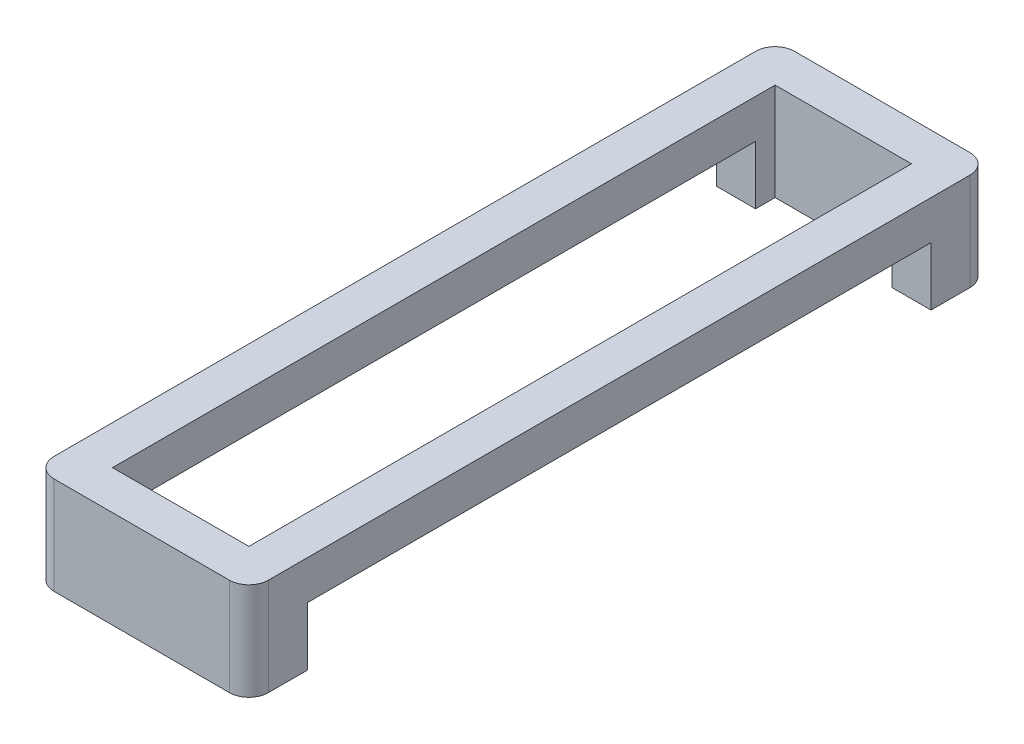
from build123d import *

# Parameters (mm, degrees)
ESQUISSE1_W             = 3.5
ESQUISSE1_H             = 17
EXTRUSION1_DEPTH        = 2.5
ESQUISSE2_W             = 16
ESQUISSE2_H             = 3.978348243
ENL_V_MAT_EXTRU_1_DEPTH = 6.25


with BuildPart() as part:
    # Esquisse1 → Extrusion1 (new body)
    with BuildSketch(Plane(origin=(0, 0, 0), x_dir=(1, 0, 0), z_dir=(0, 1, 0))):
        with BuildLine():
            Line((-2.25, -9.5), (2.25, -9.5))
            ThreePointArc((2.25, -9.5), (2.603553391, -9.353553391), (2.75, -9))
            Line((2.75, -9), (2.75, 9))
            ThreePointArc((2.75, 9), (2.603553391, 9.353553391), (2.25, 9.5))
            Line((2.25, 9.5), (-2.25, 9.5))
            ThreePointArc((-2.25, 9.5), (-2.603553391, 9.353553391), (-2.75, 9))
            Line((-2.75, 9), (-2.75, -9))
            ThreePointArc((-2.75, -9), (-2.603553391, -9.353553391), (-2.25, -9.5))
        make_face()
        Rectangle(ESQUISSE1_W, ESQUISSE1_H, mode=Mode.SUBTRACT)
    extrude(amount=-EXTRUSION1_DEPTH)

    # Esquisse2 → Enl_v. mat.-Extru.1 (cut, symmetric)
    with BuildSketch(Plane(origin=(0, 0, 0), x_dir=(0, 0, -1), z_dir=(1, 0, 0))):
        with Locations((0, -2.989174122)):
            Rectangle(ESQUISSE2_W, ESQUISSE2_H)
    extrude(amount=ENL_V_MAT_EXTRU_1_DEPTH, both=True, mode=Mode.SUBTRACT)


solid = part.part
